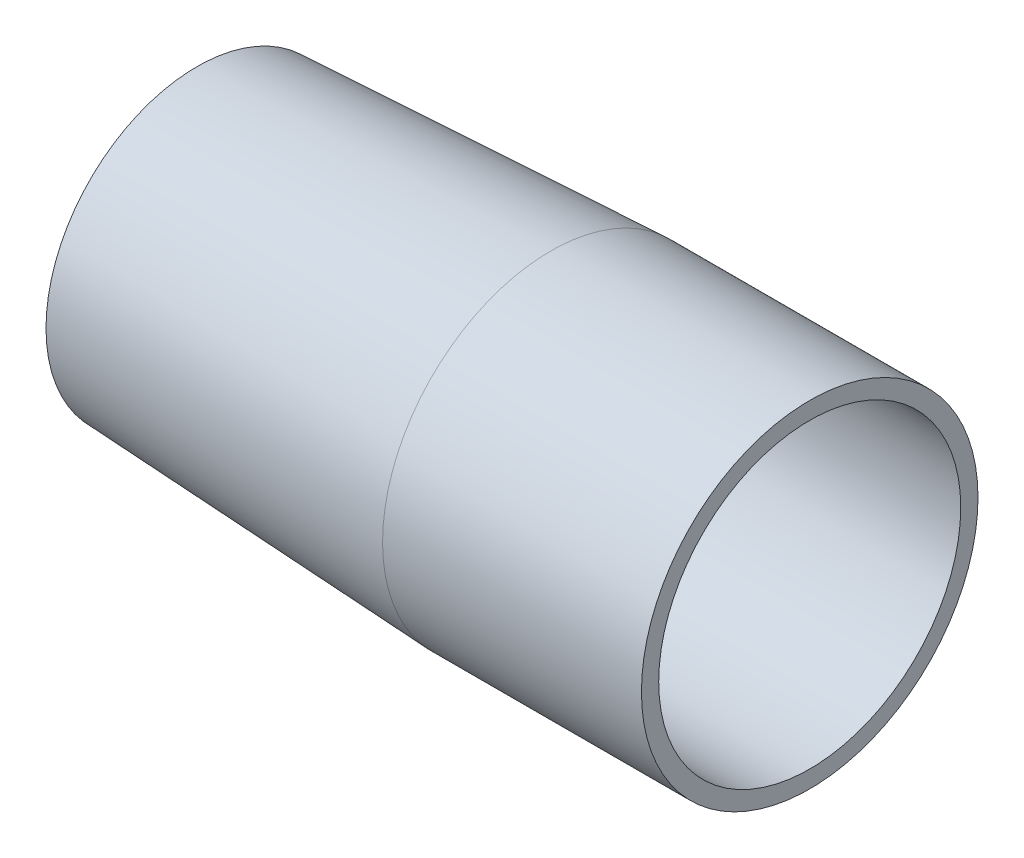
ISO-10303-21;
HEADER;
FILE_DESCRIPTION(('STEP AP214'),'2;1');
FILE_NAME('part.step','',(''),(''),'','','');
FILE_SCHEMA(('AUTOMOTIVE_DESIGN { 1 0 10303 214 1 1 1 1 }'));
ENDSEC;
DATA;
#1=APPLICATION_CONTEXT('core data for automotive mechanical design processes');
#2=APPLICATION_PROTOCOL_DEFINITION('international standard','automotive_design',2000,#1);
#3=PRODUCT_CONTEXT('',#1,'mechanical');
#4=PRODUCT('Part','Part','',(#3));
#5=PRODUCT_RELATED_PRODUCT_CATEGORY('part','',(#4));
#6=PRODUCT_DEFINITION_FORMATION('','',#4);
#7=PRODUCT_DEFINITION_CONTEXT('part definition',#1,'design');
#8=PRODUCT_DEFINITION('design','',#6,#7);
#9=PRODUCT_DEFINITION_SHAPE('','',#8);
#10=(LENGTH_UNIT() NAMED_UNIT(*) SI_UNIT(.MILLI.,.METRE.));
#11=(NAMED_UNIT(*) PLANE_ANGLE_UNIT() SI_UNIT($,.RADIAN.));
#12=(NAMED_UNIT(*) SI_UNIT($,.STERADIAN.) SOLID_ANGLE_UNIT());
#13=UNCERTAINTY_MEASURE_WITH_UNIT(LENGTH_MEASURE(1.E-05),#10,'distance_accuracy_value','');
#14=(GEOMETRIC_REPRESENTATION_CONTEXT(3) GLOBAL_UNCERTAINTY_ASSIGNED_CONTEXT((#13)) GLOBAL_UNIT_ASSIGNED_CONTEXT((#10,
#11,#12)) REPRESENTATION_CONTEXT('',''));
#15=CARTESIAN_POINT('',(0.,0.,0.));
#16=DIRECTION('',(0.,0.,1.));
#17=DIRECTION('',(1.,0.,0.));
#18=AXIS2_PLACEMENT_3D('',#15,#16,#17);
#19=CARTESIAN_POINT('',(-30.,0.,0.));
#20=DIRECTION('',(1.,0.,0.));
#21=DIRECTION('',(0.,0.,-1.));
#22=AXIS2_PLACEMENT_3D('',#19,#20,#21);
#23=CONICAL_SURFACE('',#22,17.5,0.0487418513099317);
#24=CARTESIAN_POINT('',(-71.0002,-6.41458130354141,14.1103807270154));
#25=CARTESIAN_POINT('',(-70.6668000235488,-6.42275135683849,14.1245316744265));
#26=CARTESIAN_POINT('',(-70.3334000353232,-6.43092129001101,14.1386824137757));
#27=CARTESIAN_POINT('',(-69.6666000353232,-6.44726091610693,14.1669834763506));
#28=CARTESIAN_POINT('',(-69.3332000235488,-6.45543060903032,14.1811337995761));
#29=CARTESIAN_POINT('',(-68.9998,-6.46360018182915,14.1952839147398));
#30=B_SPLINE_CURVE_WITH_KNOTS('',3,(#24,#25,#26,#27,#28,#29),.UNSPECIFIED.,.F.,.F.,(4,2,4),(0.,
1.00140046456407,2.00280092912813),.UNSPECIFIED.);
#31=CARTESIAN_POINT('',(-71.,-6.41458620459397,14.1103892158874));
#32=VERTEX_POINT('',#31);
#33=CARTESIAN_POINT('',(-69.,-6.4635952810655,14.1952754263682));
#34=VERTEX_POINT('',#33);
#35=EDGE_CURVE('E156',#32,#34,#30,.T.);
#36=ORIENTED_EDGE('',*,*,#35,.F.);
#37=CARTESIAN_POINT('',(-71.,0.,0.));
#38=DIRECTION('',(-1.,0.,0.));
#39=DIRECTION('',(0.,0.,1.));
#40=AXIS2_PLACEMENT_3D('',#37,#38,#39);
#41=CIRCLE('',#40,15.5);
#42=CARTESIAN_POINT('',(-71.,15.4272486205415,1.5));
#43=VERTEX_POINT('',#42);
#44=EDGE_CURVE('E125',#32,#43,#41,.T.);
#45=ORIENTED_EDGE('',*,*,#44,.T.);
#46=CARTESIAN_POINT('',(-63.5373696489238,15.7929563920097,1.5));
#47=CARTESIAN_POINT('',(-65.8564732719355,15.6793207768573,1.5));
#48=CARTESIAN_POINT('',(-68.175576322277,15.5656734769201,1.5));
#49=CARTESIAN_POINT('',(-72.8137812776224,15.3383555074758,1.5));
#50=CARTESIAN_POINT('',(-75.1328831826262,15.2246848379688,1.5));
#51=CARTESIAN_POINT('',(-77.4519845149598,15.1110024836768,1.5));
#52=B_SPLINE_CURVE_WITH_KNOTS('',3,(#46,#47,#48,#49,#50,#51),.UNSPECIFIED.,.F.,.F.,(4,2,4),(0.,
6.96565804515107,13.93131609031),.UNSPECIFIED.);
#53=CARTESIAN_POINT('',(-69.,15.5252667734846,1.5));
#54=VERTEX_POINT('',#53);
#55=EDGE_CURVE('E221',#54,#43,#52,.T.);
#56=ORIENTED_EDGE('',*,*,#55,.F.);
#57=CARTESIAN_POINT('',(-69.,0.,0.));
#58=DIRECTION('',(-1.,0.,0.));
#59=DIRECTION('',(0.,0.,1.));
#60=AXIS2_PLACEMENT_3D('',#57,#58,#59);
#61=CIRCLE('',#60,15.5975609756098);
#62=CARTESIAN_POINT('',(-69.,15.5252667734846,-1.5));
#63=VERTEX_POINT('',#62);
#64=EDGE_CURVE('E282',#54,#63,#61,.T.);
#65=ORIENTED_EDGE('',*,*,#64,.T.);
#66=CARTESIAN_POINT('',(-77.4519845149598,15.1110024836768,-1.5));
#67=CARTESIAN_POINT('',(-75.1328831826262,15.2246848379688,-1.5));
#68=CARTESIAN_POINT('',(-72.8137812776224,15.3383555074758,-1.5));
#69=CARTESIAN_POINT('',(-68.175576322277,15.5656734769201,-1.5));
#70=CARTESIAN_POINT('',(-65.8564732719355,15.6793207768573,-1.5));
#71=CARTESIAN_POINT('',(-63.5373696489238,15.7929563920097,-1.5));
#72=B_SPLINE_CURVE_WITH_KNOTS('',3,(#66,#67,#68,#69,#70,#71),.UNSPECIFIED.,.F.,.F.,(4,2,4),(0.,
6.96565804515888,13.93131609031),.UNSPECIFIED.);
#73=CARTESIAN_POINT('',(-71.,15.4272486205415,-1.5));
#74=VERTEX_POINT('',#73);
#75=EDGE_CURVE('E228',#74,#63,#72,.T.);
#76=ORIENTED_EDGE('',*,*,#75,.F.);
#77=CARTESIAN_POINT('',(-71.,-6.41458620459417,-14.1103892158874));
#78=VERTEX_POINT('',#77);
#79=EDGE_CURVE('E280',#74,#78,#41,.T.);
#80=ORIENTED_EDGE('',*,*,#79,.T.);
#81=CARTESIAN_POINT('',(-68.9998,-6.46360018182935,-14.1952839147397));
#82=CARTESIAN_POINT('',(-69.3332000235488,-6.45543060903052,-14.181133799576));
#83=CARTESIAN_POINT('',(-69.6666000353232,-6.44726091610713,-14.1669834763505));
#84=CARTESIAN_POINT('',(-70.3334000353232,-6.43092129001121,-14.1386824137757));
#85=CARTESIAN_POINT('',(-70.6668000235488,-6.42275135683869,-14.1245316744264));
#86=CARTESIAN_POINT('',(-71.0002,-6.41458130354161,-14.1103807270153));
#87=B_SPLINE_CURVE_WITH_KNOTS('',3,(#81,#82,#83,#84,#85,#86),.UNSPECIFIED.,.F.,.F.,(4,2,4),(0.,
1.00140046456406,2.00280092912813),.UNSPECIFIED.);
#88=CARTESIAN_POINT('',(-69.,-6.4635952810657,-14.1952754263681));
#89=VERTEX_POINT('',#88);
#90=EDGE_CURVE('E186',#89,#78,#87,.T.);
#91=ORIENTED_EDGE('',*,*,#90,.F.);
#92=CARTESIAN_POINT('',(-69.,0.,0.));
#93=DIRECTION('',(-1.,0.,0.));
#94=DIRECTION('',(0.,0.,1.));
#95=AXIS2_PLACEMENT_3D('',#92,#93,#94);
#96=CIRCLE('',#95,15.5975609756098);
#97=CARTESIAN_POINT('',(-69.,-9.06167149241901,-12.6952754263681));
#98=VERTEX_POINT('',#97);
#99=EDGE_CURVE('E39',#89,#98,#96,.T.);
#100=ORIENTED_EDGE('',*,*,#99,.T.);
#101=CARTESIAN_POINT('',(-71.0002,-9.01265751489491,-12.6103807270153));
#102=CARTESIAN_POINT('',(-70.6668000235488,-9.020827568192,-12.6245316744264));
#103=CARTESIAN_POINT('',(-70.3334000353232,-9.02899750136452,-12.6386824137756));
#104=CARTESIAN_POINT('',(-69.6666000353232,-9.04533712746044,-12.6669834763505));
#105=CARTESIAN_POINT('',(-69.3332000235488,-9.05350682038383,-12.681133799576));
#106=CARTESIAN_POINT('',(-68.9998,-9.06167639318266,-12.6952839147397));
#107=B_SPLINE_CURVE_WITH_KNOTS('',3,(#101,#102,#103,#104,#105,#106),.UNSPECIFIED.,.F.,.F.,(4,2,
4),(0.,1.00140046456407,2.00280092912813),.UNSPECIFIED.);
#108=CARTESIAN_POINT('',(-71.,-9.01266241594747,-12.6103892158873));
#109=VERTEX_POINT('',#108);
#110=EDGE_CURVE('E193',#109,#98,#107,.T.);
#111=ORIENTED_EDGE('',*,*,#110,.F.);
#112=CARTESIAN_POINT('',(-71.,-9.0126624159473,12.6103892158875));
#113=VERTEX_POINT('',#112);
#114=EDGE_CURVE('E283',#109,#113,#41,.T.);
#115=ORIENTED_EDGE('',*,*,#114,.T.);
#116=CARTESIAN_POINT('',(-68.9998,-9.06167639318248,12.6952839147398));
#117=CARTESIAN_POINT('',(-69.3332000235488,-9.05350682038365,12.6811337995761));
#118=CARTESIAN_POINT('',(-69.6666000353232,-9.04533712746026,12.6669834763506));
#119=CARTESIAN_POINT('',(-70.3334000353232,-9.02899750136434,12.6386824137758));
#120=CARTESIAN_POINT('',(-70.6668000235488,-9.02082756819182,12.6245316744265));
#121=CARTESIAN_POINT('',(-71.0002,-9.01265751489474,12.6103807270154));
#122=B_SPLINE_CURVE_WITH_KNOTS('',3,(#116,#117,#118,#119,#120,#121),.UNSPECIFIED.,.F.,.F.,(4,2,
4),(0.,1.00140046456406,2.00280092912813),.UNSPECIFIED.);
#123=CARTESIAN_POINT('',(-69.,-9.06167149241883,12.6952754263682));
#124=VERTEX_POINT('',#123);
#125=EDGE_CURVE('E49',#124,#113,#122,.T.);
#126=ORIENTED_EDGE('',*,*,#125,.F.);
#127=CARTESIAN_POINT('',(-69.,0.,0.));
#128=DIRECTION('',(-1.,0.,0.));
#129=DIRECTION('',(0.,0.,1.));
#130=AXIS2_PLACEMENT_3D('',#127,#128,#129);
#131=CIRCLE('',#130,15.5975609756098);
#132=EDGE_CURVE('E11',#124,#34,#131,.T.);
#133=ORIENTED_EDGE('',*,*,#132,.T.);
#134=EDGE_LOOP('',(#36,#45,#56,#65,#76,#80,#91,#100,#111,#115,#126,#133));
#135=FACE_BOUND('',#134,.T.);
#136=CARTESIAN_POINT('',(-30.,0.,0.));
#137=DIRECTION('',(-1.,0.,0.));
#138=DIRECTION('',(0.,0.,1.));
#139=AXIS2_PLACEMENT_3D('',#136,#137,#138);
#140=CIRCLE('',#139,17.5);
#141=CARTESIAN_POINT('',(-30.,0.,17.5));
#142=VERTEX_POINT('',#141);
#143=EDGE_CURVE('E237',#142,#142,#140,.T.);
#144=ORIENTED_EDGE('',*,*,#143,.F.);
#145=EDGE_LOOP('',(#144));
#146=FACE_BOUND('',#145,.T.);
#147=ADVANCED_FACE('F31',(#135,#146),#23,.F.);
#148=CARTESIAN_POINT('',(-71.,-15.5,0.));
#149=DIRECTION('',(-1.,0.,0.));
#150=DIRECTION('',(0.,0.,1.));
#151=AXIS2_PLACEMENT_3D('',#148,#149,#150);
#152=PLANE('',#151);
#153=ORIENTED_EDGE('',*,*,#44,.F.);
#154=DIRECTION('',(0.,0.499999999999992,-0.866025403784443));
#155=VECTOR('',#154,1.);
#156=CARTESIAN_POINT('',(-71.,-5.91875978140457,13.2515926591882));
#157=LINE('',#156,#155);
#158=CARTESIAN_POINT('',(-71.,-5.91875978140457,13.2515926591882));
#159=VERTEX_POINT('',#158);
#160=EDGE_CURVE('E117',#32,#159,#157,.T.);
#161=ORIENTED_EDGE('',*,*,#160,.T.);
#162=DIRECTION('',(0.,-0.866025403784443,-0.499999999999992));
#163=VECTOR('',#162,1.);
#164=CARTESIAN_POINT('',(-71.,-5.91875978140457,13.2515926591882));
#165=LINE('',#164,#163);
#166=CARTESIAN_POINT('',(-71.,-8.5168359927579,11.7515926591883));
#167=VERTEX_POINT('',#166);
#168=EDGE_CURVE('E123',#159,#167,#165,.T.);
#169=ORIENTED_EDGE('',*,*,#168,.T.);
#170=DIRECTION('',(0.,-0.499999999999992,0.866025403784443));
#171=VECTOR('',#170,1.);
#172=CARTESIAN_POINT('',(-71.,-8.5168359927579,11.7515926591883));
#173=LINE('',#172,#171);
#174=EDGE_CURVE('E141',#167,#113,#173,.T.);
#175=ORIENTED_EDGE('',*,*,#174,.T.);
#176=ORIENTED_EDGE('',*,*,#114,.F.);
#177=DIRECTION('',(0.,0.500000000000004,0.866025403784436));
#178=VECTOR('',#177,1.);
#179=CARTESIAN_POINT('',(-71.,-8.51683599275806,-11.7515926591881));
#180=LINE('',#179,#178);
#181=CARTESIAN_POINT('',(-71.,-8.51683599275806,-11.7515926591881));
#182=VERTEX_POINT('',#181);
#183=EDGE_CURVE('E293',#109,#182,#180,.T.);
#184=ORIENTED_EDGE('',*,*,#183,.T.);
#185=DIRECTION('',(0.,0.866025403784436,-0.500000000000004));
#186=VECTOR('',#185,1.);
#187=CARTESIAN_POINT('',(-71.,-8.51683599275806,-11.7515926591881));
#188=LINE('',#187,#186);
#189=CARTESIAN_POINT('',(-71.,-5.91875978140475,-13.2515926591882));
#190=VERTEX_POINT('',#189);
#191=EDGE_CURVE('E302',#182,#190,#188,.T.);
#192=ORIENTED_EDGE('',*,*,#191,.T.);
#193=DIRECTION('',(0.,-0.500000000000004,-0.866025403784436));
#194=VECTOR('',#193,1.);
#195=CARTESIAN_POINT('',(-71.,-5.91875978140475,-13.2515926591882));
#196=LINE('',#195,#194);
#197=EDGE_CURVE('E297',#190,#78,#196,.T.);
#198=ORIENTED_EDGE('',*,*,#197,.T.);
#199=ORIENTED_EDGE('',*,*,#79,.F.);
#200=DIRECTION('',(0.,-1.,0.));
#201=VECTOR('',#200,1.);
#202=CARTESIAN_POINT('',(-71.,14.4355957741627,-1.5));
#203=LINE('',#202,#201);
#204=CARTESIAN_POINT('',(-71.,14.4355957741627,-1.5));
#205=VERTEX_POINT('',#204);
#206=EDGE_CURVE('E202',#74,#205,#203,.T.);
#207=ORIENTED_EDGE('',*,*,#206,.T.);
#208=DIRECTION('',(0.,0.,1.));
#209=VECTOR('',#208,1.);
#210=CARTESIAN_POINT('',(-71.,14.4355957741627,-1.5));
#211=LINE('',#210,#209);
#212=CARTESIAN_POINT('',(-71.,14.4355957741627,1.5));
#213=VERTEX_POINT('',#212);
#214=EDGE_CURVE('E320',#205,#213,#211,.T.);
#215=ORIENTED_EDGE('',*,*,#214,.T.);
#216=DIRECTION('',(0.,1.,0.));
#217=VECTOR('',#216,1.);
#218=CARTESIAN_POINT('',(-71.,14.4355957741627,1.5));
#219=LINE('',#218,#217);
#220=EDGE_CURVE('E315',#213,#43,#219,.T.);
#221=ORIENTED_EDGE('',*,*,#220,.T.);
#222=EDGE_LOOP('',(#153,#161,#169,#175,#176,#184,#192,#198,#199,#207,#215,#221));
#223=FACE_BOUND('',#222,.T.);
#224=CARTESIAN_POINT('',(-71.,0.,0.));
#225=DIRECTION('',(-1.,0.,0.));
#226=DIRECTION('',(0.,0.,1.));
#227=AXIS2_PLACEMENT_3D('',#224,#225,#226);
#228=CIRCLE('',#227,17.5);
#229=CARTESIAN_POINT('',(-71.,0.,17.5));
#230=VERTEX_POINT('',#229);
#231=EDGE_CURVE('E277',#230,#230,#228,.T.);
#232=ORIENTED_EDGE('',*,*,#231,.T.);
#233=EDGE_LOOP('',(#232));
#234=FACE_BOUND('',#233,.T.);
#235=ADVANCED_FACE('F119',(#223,#234),#152,.T.);
#236=CARTESIAN_POINT('',(-71.,0.,0.));
#237=DIRECTION('',(1.,0.,0.));
#238=DIRECTION('',(0.,0.,-1.));
#239=AXIS2_PLACEMENT_3D('',#236,#237,#238);
#240=CONICAL_SURFACE('',#239,17.5,0.0487418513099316);
#241=CARTESIAN_POINT('',(-30.,0.,0.));
#242=DIRECTION('',(-1.,0.,0.));
#243=DIRECTION('',(0.,0.,1.));
#244=AXIS2_PLACEMENT_3D('',#241,#242,#243);
#245=CIRCLE('',#244,19.5);
#246=CARTESIAN_POINT('',(-30.,0.,19.5));
#247=VERTEX_POINT('',#246);
#248=EDGE_CURVE('E272',#247,#247,#245,.T.);
#249=ORIENTED_EDGE('',*,*,#248,.T.);
#250=EDGE_LOOP('',(#249));
#251=FACE_BOUND('',#250,.T.);
#252=ORIENTED_EDGE('',*,*,#231,.F.);
#253=EDGE_LOOP('',(#252));
#254=FACE_BOUND('',#253,.T.);
#255=ADVANCED_FACE('F254',(#251,#254),#240,.T.);
#256=CARTESIAN_POINT('',(-49.,0.,0.));
#257=DIRECTION('',(-1.,0.,0.));
#258=DIRECTION('',(0.,0.,1.));
#259=AXIS2_PLACEMENT_3D('',#256,#257,#258);
#260=CYLINDRICAL_SURFACE('',#259,19.5);
#261=CARTESIAN_POINT('',(0.,0.,0.));
#262=DIRECTION('',(-1.,0.,0.));
#263=DIRECTION('',(0.,0.,1.));
#264=AXIS2_PLACEMENT_3D('',#261,#262,#263);
#265=CIRCLE('',#264,19.5);
#266=CARTESIAN_POINT('',(0.,0.,19.5));
#267=VERTEX_POINT('',#266);
#268=EDGE_CURVE('E269',#267,#267,#265,.T.);
#269=ORIENTED_EDGE('',*,*,#268,.T.);
#270=EDGE_LOOP('',(#269));
#271=FACE_BOUND('',#270,.T.);
#272=ORIENTED_EDGE('',*,*,#248,.F.);
#273=EDGE_LOOP('',(#272));
#274=FACE_BOUND('',#273,.T.);
#275=ADVANCED_FACE('F250',(#271,#274),#260,.T.);
#276=CARTESIAN_POINT('',(0.,-19.5,0.));
#277=DIRECTION('',(1.,0.,0.));
#278=DIRECTION('',(0.,0.,-1.));
#279=AXIS2_PLACEMENT_3D('',#276,#277,#278);
#280=PLANE('',#279);
#281=CARTESIAN_POINT('',(0.,0.,0.));
#282=DIRECTION('',(-1.,0.,0.));
#283=DIRECTION('',(0.,0.,1.));
#284=AXIS2_PLACEMENT_3D('',#281,#282,#283);
#285=CIRCLE('',#284,17.5);
#286=CARTESIAN_POINT('',(0.,0.,17.5));
#287=VERTEX_POINT('',#286);
#288=EDGE_CURVE('E267',#287,#287,#285,.T.);
#289=ORIENTED_EDGE('',*,*,#288,.T.);
#290=EDGE_LOOP('',(#289));
#291=FACE_BOUND('',#290,.T.);
#292=ORIENTED_EDGE('',*,*,#268,.F.);
#293=EDGE_LOOP('',(#292));
#294=FACE_BOUND('',#293,.T.);
#295=ADVANCED_FACE('F246',(#291,#294),#280,.T.);
#296=CARTESIAN_POINT('',(-49.,0.,0.));
#297=DIRECTION('',(-1.,0.,0.));
#298=DIRECTION('',(0.,0.,1.));
#299=AXIS2_PLACEMENT_3D('',#296,#297,#298);
#300=CYLINDRICAL_SURFACE('',#299,17.5);
#301=ORIENTED_EDGE('',*,*,#143,.T.);
#302=EDGE_LOOP('',(#301));
#303=FACE_BOUND('',#302,.T.);
#304=ORIENTED_EDGE('',*,*,#288,.F.);
#305=EDGE_LOOP('',(#304));
#306=FACE_BOUND('',#305,.T.);
#307=ADVANCED_FACE('F242',(#303,#306),#300,.F.);
#308=CARTESIAN_POINT('',(-69.,14.4355957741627,-1.5));
#309=DIRECTION('',(0.,0.,-1.));
#310=DIRECTION('',(-1.,0.,0.));
#311=AXIS2_PLACEMENT_3D('',#308,#309,#310);
#312=PLANE('',#311);
#313=ORIENTED_EDGE('',*,*,#206,.F.);
#314=ORIENTED_EDGE('',*,*,#75,.T.);
#315=DIRECTION('',(0.,-1.,0.));
#316=VECTOR('',#315,1.);
#317=CARTESIAN_POINT('',(-69.,14.4355957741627,-1.5));
#318=LINE('',#317,#316);
#319=CARTESIAN_POINT('',(-69.,14.4355957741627,-1.5));
#320=VERTEX_POINT('',#319);
#321=EDGE_CURVE('E321',#63,#320,#318,.T.);
#322=ORIENTED_EDGE('',*,*,#321,.T.);
#323=DIRECTION('',(-1.,0.,0.));
#324=VECTOR('',#323,1.);
#325=CARTESIAN_POINT('',(-69.,14.4355957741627,-1.5));
#326=LINE('',#325,#324);
#327=EDGE_CURVE('E230',#320,#205,#326,.T.);
#328=ORIENTED_EDGE('',*,*,#327,.T.);
#329=EDGE_LOOP('',(#313,#314,#322,#328));
#330=FACE_BOUND('',#329,.T.);
#331=ADVANCED_FACE('F217',(#330),#312,.T.);
#332=CARTESIAN_POINT('',(-69.,14.4355957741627,1.5));
#333=DIRECTION('',(0.,0.,1.));
#334=DIRECTION('',(1.,0.,0.));
#335=AXIS2_PLACEMENT_3D('',#332,#333,#334);
#336=PLANE('',#335);
#337=DIRECTION('',(0.,1.,0.));
#338=VECTOR('',#337,1.);
#339=CARTESIAN_POINT('',(-69.,14.4355957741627,1.5));
#340=LINE('',#339,#338);
#341=CARTESIAN_POINT('',(-69.,14.4355957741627,1.5));
#342=VERTEX_POINT('',#341);
#343=EDGE_CURVE('E318',#342,#54,#340,.T.);
#344=ORIENTED_EDGE('',*,*,#343,.T.);
#345=ORIENTED_EDGE('',*,*,#55,.T.);
#346=ORIENTED_EDGE('',*,*,#220,.F.);
#347=DIRECTION('',(-1.,0.,0.));
#348=VECTOR('',#347,1.);
#349=CARTESIAN_POINT('',(-69.,14.4355957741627,1.5));
#350=LINE('',#349,#348);
#351=EDGE_CURVE('E229',#342,#213,#350,.T.);
#352=ORIENTED_EDGE('',*,*,#351,.F.);
#353=EDGE_LOOP('',(#344,#345,#346,#352));
#354=FACE_BOUND('',#353,.T.);
#355=ADVANCED_FACE('F213',(#354),#336,.T.);
#356=CARTESIAN_POINT('',(-69.,14.4355957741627,-1.5));
#357=DIRECTION('',(0.,-1.,0.));
#358=DIRECTION('',(0.,0.,-1.));
#359=AXIS2_PLACEMENT_3D('',#356,#357,#358);
#360=PLANE('',#359);
#361=ORIENTED_EDGE('',*,*,#214,.F.);
#362=ORIENTED_EDGE('',*,*,#327,.F.);
#363=DIRECTION('',(0.,0.,1.));
#364=VECTOR('',#363,1.);
#365=CARTESIAN_POINT('',(-69.,14.4355957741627,-1.5));
#366=LINE('',#365,#364);
#367=EDGE_CURVE('E323',#320,#342,#366,.T.);
#368=ORIENTED_EDGE('',*,*,#367,.T.);
#369=ORIENTED_EDGE('',*,*,#351,.T.);
#370=EDGE_LOOP('',(#361,#362,#368,#369));
#371=FACE_BOUND('',#370,.T.);
#372=ADVANCED_FACE('F211',(#371),#360,.T.);
#373=CARTESIAN_POINT('',(-69.,0.,0.));
#374=DIRECTION('',(-1.,0.,0.));
#375=DIRECTION('',(0.,0.,1.));
#376=AXIS2_PLACEMENT_3D('',#373,#374,#375);
#377=PLANE('',#376);
#378=ORIENTED_EDGE('',*,*,#64,.F.);
#379=ORIENTED_EDGE('',*,*,#343,.F.);
#380=ORIENTED_EDGE('',*,*,#367,.F.);
#381=ORIENTED_EDGE('',*,*,#321,.F.);
#382=EDGE_LOOP('',(#378,#379,#380,#381));
#383=FACE_BOUND('',#382,.T.);
#384=ADVANCED_FACE('F207',(#383),#377,.F.);
#385=CARTESIAN_POINT('',(-69.,-8.51683599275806,-11.7515926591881));
#386=DIRECTION('',(0.,-0.866025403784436,0.500000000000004));
#387=DIRECTION('',(0.,-0.500000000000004,-0.866025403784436));
#388=AXIS2_PLACEMENT_3D('',#385,#386,#387);
#389=PLANE('',#388);
#390=ORIENTED_EDGE('',*,*,#183,.F.);
#391=ORIENTED_EDGE('',*,*,#110,.T.);
#392=DIRECTION('',(0.,0.500000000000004,0.866025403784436));
#393=VECTOR('',#392,1.);
#394=CARTESIAN_POINT('',(-69.,-8.51683599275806,-11.7515926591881));
#395=LINE('',#394,#393);
#396=CARTESIAN_POINT('',(-69.,-8.51683599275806,-11.7515926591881));
#397=VERTEX_POINT('',#396);
#398=EDGE_CURVE('E291',#98,#397,#395,.T.);
#399=ORIENTED_EDGE('',*,*,#398,.T.);
#400=DIRECTION('',(-1.,0.,0.));
#401=VECTOR('',#400,1.);
#402=CARTESIAN_POINT('',(-69.,-8.51683599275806,-11.7515926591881));
#403=LINE('',#402,#401);
#404=EDGE_CURVE('E195',#397,#182,#403,.T.);
#405=ORIENTED_EDGE('',*,*,#404,.T.);
#406=EDGE_LOOP('',(#390,#391,#399,#405));
#407=FACE_BOUND('',#406,.T.);
#408=ADVANCED_FACE('F182',(#407),#389,.T.);
#409=CARTESIAN_POINT('',(-69.,-5.91875978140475,-13.2515926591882));
#410=DIRECTION('',(0.,0.866025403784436,-0.500000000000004));
#411=DIRECTION('',(0.,0.500000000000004,0.866025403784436));
#412=AXIS2_PLACEMENT_3D('',#409,#410,#411);
#413=PLANE('',#412);
#414=DIRECTION('',(0.,-0.500000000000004,-0.866025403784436));
#415=VECTOR('',#414,1.);
#416=CARTESIAN_POINT('',(-69.,-5.91875978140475,-13.2515926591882));
#417=LINE('',#416,#415);
#418=CARTESIAN_POINT('',(-69.,-5.91875978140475,-13.2515926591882));
#419=VERTEX_POINT('',#418);
#420=EDGE_CURVE('E299',#419,#89,#417,.T.);
#421=ORIENTED_EDGE('',*,*,#420,.T.);
#422=ORIENTED_EDGE('',*,*,#90,.T.);
#423=ORIENTED_EDGE('',*,*,#197,.F.);
#424=DIRECTION('',(-1.,0.,0.));
#425=VECTOR('',#424,1.);
#426=CARTESIAN_POINT('',(-69.,-5.91875978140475,-13.2515926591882));
#427=LINE('',#426,#425);
#428=EDGE_CURVE('E194',#419,#190,#427,.T.);
#429=ORIENTED_EDGE('',*,*,#428,.F.);
#430=EDGE_LOOP('',(#421,#422,#423,#429));
#431=FACE_BOUND('',#430,.T.);
#432=ADVANCED_FACE('F178',(#431),#413,.T.);
#433=CARTESIAN_POINT('',(-69.,-8.51683599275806,-11.7515926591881));
#434=DIRECTION('',(0.,0.500000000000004,0.866025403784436));
#435=DIRECTION('',(0.,-0.866025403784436,0.500000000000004));
#436=AXIS2_PLACEMENT_3D('',#433,#434,#435);
#437=PLANE('',#436);
#438=ORIENTED_EDGE('',*,*,#191,.F.);
#439=ORIENTED_EDGE('',*,*,#404,.F.);
#440=DIRECTION('',(0.,0.866025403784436,-0.500000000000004));
#441=VECTOR('',#440,1.);
#442=CARTESIAN_POINT('',(-69.,-8.51683599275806,-11.7515926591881));
#443=LINE('',#442,#441);
#444=EDGE_CURVE('E296',#397,#419,#443,.T.);
#445=ORIENTED_EDGE('',*,*,#444,.T.);
#446=ORIENTED_EDGE('',*,*,#428,.T.);
#447=EDGE_LOOP('',(#438,#439,#445,#446));
#448=FACE_BOUND('',#447,.T.);
#449=ADVANCED_FACE('F176',(#448),#437,.T.);
#450=CARTESIAN_POINT('',(-69.,0.,0.));
#451=DIRECTION('',(-1.,0.,0.));
#452=DIRECTION('',(0.,0.866025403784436,-0.500000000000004));
#453=AXIS2_PLACEMENT_3D('',#450,#451,#452);
#454=PLANE('',#453);
#455=ORIENTED_EDGE('',*,*,#99,.F.);
#456=ORIENTED_EDGE('',*,*,#420,.F.);
#457=ORIENTED_EDGE('',*,*,#444,.F.);
#458=ORIENTED_EDGE('',*,*,#398,.F.);
#459=EDGE_LOOP('',(#455,#456,#457,#458));
#460=FACE_BOUND('',#459,.T.);
#461=ADVANCED_FACE('F173',(#460),#454,.F.);
#462=CARTESIAN_POINT('',(-69.,-5.91875978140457,13.2515926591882));
#463=DIRECTION('',(0.,0.866025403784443,0.499999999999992));
#464=DIRECTION('',(0.,-0.499999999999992,0.866025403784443));
#465=AXIS2_PLACEMENT_3D('',#462,#463,#464);
#466=PLANE('',#465);
#467=ORIENTED_EDGE('',*,*,#160,.F.);
#468=ORIENTED_EDGE('',*,*,#35,.T.);
#469=DIRECTION('',(0.,0.499999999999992,-0.866025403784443));
#470=VECTOR('',#469,1.);
#471=CARTESIAN_POINT('',(-69.,-5.91875978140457,13.2515926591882));
#472=LINE('',#471,#470);
#473=CARTESIAN_POINT('',(-69.,-5.91875978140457,13.2515926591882));
#474=VERTEX_POINT('',#473);
#475=EDGE_CURVE('E132',#34,#474,#472,.T.);
#476=ORIENTED_EDGE('',*,*,#475,.T.);
#477=DIRECTION('',(-1.,0.,0.));
#478=VECTOR('',#477,1.);
#479=CARTESIAN_POINT('',(-69.,-5.91875978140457,13.2515926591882));
#480=LINE('',#479,#478);
#481=EDGE_CURVE('E129',#474,#159,#480,.T.);
#482=ORIENTED_EDGE('',*,*,#481,.T.);
#483=EDGE_LOOP('',(#467,#468,#476,#482));
#484=FACE_BOUND('',#483,.T.);
#485=ADVANCED_FACE('F130',(#484),#466,.T.);
#486=CARTESIAN_POINT('',(-69.,-8.5168359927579,11.7515926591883));
#487=DIRECTION('',(0.,-0.866025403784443,-0.499999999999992));
#488=DIRECTION('',(0.,0.499999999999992,-0.866025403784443));
#489=AXIS2_PLACEMENT_3D('',#486,#487,#488);
#490=PLANE('',#489);
#491=DIRECTION('',(0.,-0.499999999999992,0.866025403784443));
#492=VECTOR('',#491,1.);
#493=CARTESIAN_POINT('',(-69.,-8.5168359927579,11.7515926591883));
#494=LINE('',#493,#492);
#495=CARTESIAN_POINT('',(-69.,-8.5168359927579,11.7515926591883));
#496=VERTEX_POINT('',#495);
#497=EDGE_CURVE('E137',#496,#124,#494,.T.);
#498=ORIENTED_EDGE('',*,*,#497,.T.);
#499=ORIENTED_EDGE('',*,*,#125,.T.);
#500=ORIENTED_EDGE('',*,*,#174,.F.);
#501=DIRECTION('',(-1.,0.,0.));
#502=VECTOR('',#501,1.);
#503=CARTESIAN_POINT('',(-69.,-8.5168359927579,11.7515926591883));
#504=LINE('',#503,#502);
#505=EDGE_CURVE('E136',#496,#167,#504,.T.);
#506=ORIENTED_EDGE('',*,*,#505,.F.);
#507=EDGE_LOOP('',(#498,#499,#500,#506));
#508=FACE_BOUND('',#507,.T.);
#509=ADVANCED_FACE('F162',(#508),#490,.T.);
#510=CARTESIAN_POINT('',(-69.,-5.91875978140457,13.2515926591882));
#511=DIRECTION('',(0.,0.499999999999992,-0.866025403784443));
#512=DIRECTION('',(0.,0.866025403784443,0.499999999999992));
#513=AXIS2_PLACEMENT_3D('',#510,#511,#512);
#514=PLANE('',#513);
#515=ORIENTED_EDGE('',*,*,#168,.F.);
#516=ORIENTED_EDGE('',*,*,#481,.F.);
#517=DIRECTION('',(0.,-0.866025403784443,-0.499999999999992));
#518=VECTOR('',#517,1.);
#519=CARTESIAN_POINT('',(-69.,-5.91875978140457,13.2515926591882));
#520=LINE('',#519,#518);
#521=EDGE_CURVE('E146',#474,#496,#520,.T.);
#522=ORIENTED_EDGE('',*,*,#521,.T.);
#523=ORIENTED_EDGE('',*,*,#505,.T.);
#524=EDGE_LOOP('',(#515,#516,#522,#523));
#525=FACE_BOUND('',#524,.T.);
#526=ADVANCED_FACE('F139',(#525),#514,.T.);
#527=CARTESIAN_POINT('',(-69.,0.,0.));
#528=DIRECTION('',(-1.,0.,0.));
#529=DIRECTION('',(0.,-0.866025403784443,-0.499999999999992));
#530=AXIS2_PLACEMENT_3D('',#527,#528,#529);
#531=PLANE('',#530);
#532=ORIENTED_EDGE('',*,*,#132,.F.);
#533=ORIENTED_EDGE('',*,*,#497,.F.);
#534=ORIENTED_EDGE('',*,*,#521,.F.);
#535=ORIENTED_EDGE('',*,*,#475,.F.);
#536=EDGE_LOOP('',(#532,#533,#534,#535));
#537=FACE_BOUND('',#536,.T.);
#538=ADVANCED_FACE('F168',(#537),#531,.F.);
#539=CLOSED_SHELL('',(#147,#235,#255,#275,#295,#307,#331,#355,#372,#384,#408,#432,#449,#461,
#485,#509,#526,#538));
#540=MANIFOLD_SOLID_BREP('B2',#539);
#541=ADVANCED_BREP_SHAPE_REPRESENTATION('',(#18,#540),#14);
#542=SHAPE_DEFINITION_REPRESENTATION(#9,#541);
ENDSEC;
END-ISO-10303-21;
